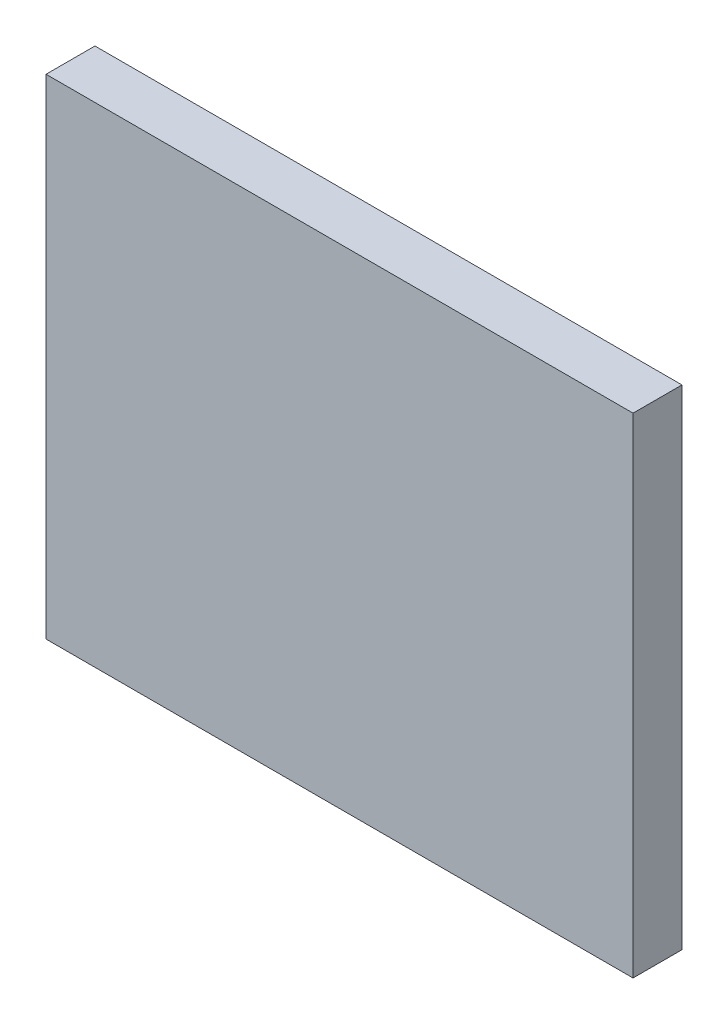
ISO-10303-21;
HEADER;
FILE_DESCRIPTION(('STEP AP214'),'2;1');
FILE_NAME('part.step','',(''),(''),'','','');
FILE_SCHEMA(('AUTOMOTIVE_DESIGN { 1 0 10303 214 1 1 1 1 }'));
ENDSEC;
DATA;
#1=APPLICATION_CONTEXT('core data for automotive mechanical design processes');
#2=APPLICATION_PROTOCOL_DEFINITION('international standard','automotive_design',2000,#1);
#3=PRODUCT_CONTEXT('',#1,'mechanical');
#4=PRODUCT('Part','Part','',(#3));
#5=PRODUCT_RELATED_PRODUCT_CATEGORY('part','',(#4));
#6=PRODUCT_DEFINITION_FORMATION('','',#4);
#7=PRODUCT_DEFINITION_CONTEXT('part definition',#1,'design');
#8=PRODUCT_DEFINITION('design','',#6,#7);
#9=PRODUCT_DEFINITION_SHAPE('','',#8);
#10=(LENGTH_UNIT() NAMED_UNIT(*) SI_UNIT(.MILLI.,.METRE.));
#11=(NAMED_UNIT(*) PLANE_ANGLE_UNIT() SI_UNIT($,.RADIAN.));
#12=(NAMED_UNIT(*) SI_UNIT($,.STERADIAN.) SOLID_ANGLE_UNIT());
#13=UNCERTAINTY_MEASURE_WITH_UNIT(LENGTH_MEASURE(1.E-05),#10,'distance_accuracy_value','');
#14=(GEOMETRIC_REPRESENTATION_CONTEXT(3) GLOBAL_UNCERTAINTY_ASSIGNED_CONTEXT((#13)) GLOBAL_UNIT_ASSIGNED_CONTEXT((#10,
#11,#12)) REPRESENTATION_CONTEXT('',''));
#15=CARTESIAN_POINT('',(0.,0.,0.));
#16=DIRECTION('',(0.,0.,1.));
#17=DIRECTION('',(1.,0.,0.));
#18=AXIS2_PLACEMENT_3D('',#15,#16,#17);
#19=CARTESIAN_POINT('',(0.,0.,5.));
#20=DIRECTION('',(1.,0.,0.));
#21=DIRECTION('',(0.,1.,0.));
#22=AXIS2_PLACEMENT_3D('',#19,#20,#21);
#23=PLANE('',#22);
#24=DIRECTION('',(0.,-1.,0.));
#25=VECTOR('',#24,1.);
#26=CARTESIAN_POINT('',(0.,0.,0.));
#27=LINE('',#26,#25);
#28=CARTESIAN_POINT('',(0.,0.,0.));
#29=VERTEX_POINT('',#28);
#30=CARTESIAN_POINT('',(0.,-50.,0.));
#31=VERTEX_POINT('',#30);
#32=EDGE_CURVE('E75',#29,#31,#27,.T.);
#33=ORIENTED_EDGE('',*,*,#32,.T.);
#34=DIRECTION('',(0.,0.,-1.));
#35=VECTOR('',#34,1.);
#36=CARTESIAN_POINT('',(0.,-50.,5.));
#37=LINE('',#36,#35);
#38=CARTESIAN_POINT('',(0.,-50.,5.));
#39=VERTEX_POINT('',#38);
#40=EDGE_CURVE('E11',#39,#31,#37,.T.);
#41=ORIENTED_EDGE('',*,*,#40,.F.);
#42=DIRECTION('',(0.,-1.,0.));
#43=VECTOR('',#42,1.);
#44=CARTESIAN_POINT('',(0.,0.,5.));
#45=LINE('',#44,#43);
#46=CARTESIAN_POINT('',(0.,0.,5.));
#47=VERTEX_POINT('',#46);
#48=EDGE_CURVE('E93',#47,#39,#45,.T.);
#49=ORIENTED_EDGE('',*,*,#48,.F.);
#50=DIRECTION('',(0.,0.,-1.));
#51=VECTOR('',#50,1.);
#52=CARTESIAN_POINT('',(0.,0.,5.));
#53=LINE('',#52,#51);
#54=EDGE_CURVE('E87',#47,#29,#53,.T.);
#55=ORIENTED_EDGE('',*,*,#54,.T.);
#56=EDGE_LOOP('',(#33,#41,#49,#55));
#57=FACE_BOUND('',#56,.T.);
#58=ADVANCED_FACE('F31',(#57),#23,.F.);
#59=CARTESIAN_POINT('',(0.,-50.,5.));
#60=DIRECTION('',(0.,1.,0.));
#61=DIRECTION('',(0.,0.,1.));
#62=AXIS2_PLACEMENT_3D('',#59,#60,#61);
#63=PLANE('',#62);
#64=DIRECTION('',(1.,0.,0.));
#65=VECTOR('',#64,1.);
#66=CARTESIAN_POINT('',(0.,-50.,0.));
#67=LINE('',#66,#65);
#68=CARTESIAN_POINT('',(60.,-50.,0.));
#69=VERTEX_POINT('',#68);
#70=EDGE_CURVE('E71',#31,#69,#67,.T.);
#71=ORIENTED_EDGE('',*,*,#70,.T.);
#72=DIRECTION('',(0.,0.,-1.));
#73=VECTOR('',#72,1.);
#74=CARTESIAN_POINT('',(60.,-50.,5.));
#75=LINE('',#74,#73);
#76=CARTESIAN_POINT('',(60.,-50.,5.));
#77=VERTEX_POINT('',#76);
#78=EDGE_CURVE('E38',#77,#69,#75,.T.);
#79=ORIENTED_EDGE('',*,*,#78,.F.);
#80=DIRECTION('',(1.,0.,0.));
#81=VECTOR('',#80,1.);
#82=CARTESIAN_POINT('',(0.,-50.,5.));
#83=LINE('',#82,#81);
#84=EDGE_CURVE('E83',#39,#77,#83,.T.);
#85=ORIENTED_EDGE('',*,*,#84,.F.);
#86=ORIENTED_EDGE('',*,*,#40,.T.);
#87=EDGE_LOOP('',(#71,#79,#85,#86));
#88=FACE_BOUND('',#87,.T.);
#89=ADVANCED_FACE('F82',(#88),#63,.F.);
#90=CARTESIAN_POINT('',(60.,0.,5.));
#91=DIRECTION('',(-1.,0.,0.));
#92=DIRECTION('',(0.,-1.,0.));
#93=AXIS2_PLACEMENT_3D('',#90,#91,#92);
#94=PLANE('',#93);
#95=DIRECTION('',(0.,1.,0.));
#96=VECTOR('',#95,1.);
#97=CARTESIAN_POINT('',(60.,0.,0.));
#98=LINE('',#97,#96);
#99=CARTESIAN_POINT('',(60.,0.,0.));
#100=VERTEX_POINT('',#99);
#101=EDGE_CURVE('E76',#69,#100,#98,.T.);
#102=ORIENTED_EDGE('',*,*,#101,.T.);
#103=DIRECTION('',(0.,0.,-1.));
#104=VECTOR('',#103,1.);
#105=CARTESIAN_POINT('',(60.,0.,5.));
#106=LINE('',#105,#104);
#107=CARTESIAN_POINT('',(60.,0.,5.));
#108=VERTEX_POINT('',#107);
#109=EDGE_CURVE('E99',#108,#100,#106,.T.);
#110=ORIENTED_EDGE('',*,*,#109,.F.);
#111=DIRECTION('',(0.,1.,0.));
#112=VECTOR('',#111,1.);
#113=CARTESIAN_POINT('',(60.,0.,5.));
#114=LINE('',#113,#112);
#115=EDGE_CURVE('E50',#77,#108,#114,.T.);
#116=ORIENTED_EDGE('',*,*,#115,.F.);
#117=ORIENTED_EDGE('',*,*,#78,.T.);
#118=EDGE_LOOP('',(#102,#110,#116,#117));
#119=FACE_BOUND('',#118,.T.);
#120=ADVANCED_FACE('F102',(#119),#94,.F.);
#121=CARTESIAN_POINT('',(0.,0.,5.));
#122=DIRECTION('',(0.,-1.,0.));
#123=DIRECTION('',(0.,0.,-1.));
#124=AXIS2_PLACEMENT_3D('',#121,#122,#123);
#125=PLANE('',#124);
#126=DIRECTION('',(-1.,0.,0.));
#127=VECTOR('',#126,1.);
#128=CARTESIAN_POINT('',(0.,0.,0.));
#129=LINE('',#128,#127);
#130=EDGE_CURVE('E91',#100,#29,#129,.T.);
#131=ORIENTED_EDGE('',*,*,#130,.T.);
#132=ORIENTED_EDGE('',*,*,#54,.F.);
#133=DIRECTION('',(-1.,0.,0.));
#134=VECTOR('',#133,1.);
#135=CARTESIAN_POINT('',(0.,0.,5.));
#136=LINE('',#135,#134);
#137=EDGE_CURVE('E45',#108,#47,#136,.T.);
#138=ORIENTED_EDGE('',*,*,#137,.F.);
#139=ORIENTED_EDGE('',*,*,#109,.T.);
#140=EDGE_LOOP('',(#131,#132,#138,#139));
#141=FACE_BOUND('',#140,.T.);
#142=ADVANCED_FACE('F104',(#141),#125,.F.);
#143=CARTESIAN_POINT('',(0.,-50.,5.));
#144=DIRECTION('',(0.,0.,1.));
#145=DIRECTION('',(1.,0.,0.));
#146=AXIS2_PLACEMENT_3D('',#143,#144,#145);
#147=PLANE('',#146);
#148=ORIENTED_EDGE('',*,*,#48,.T.);
#149=ORIENTED_EDGE('',*,*,#84,.T.);
#150=ORIENTED_EDGE('',*,*,#115,.T.);
#151=ORIENTED_EDGE('',*,*,#137,.T.);
#152=EDGE_LOOP('',(#148,#149,#150,#151));
#153=FACE_BOUND('',#152,.T.);
#154=ADVANCED_FACE('F105',(#153),#147,.T.);
#155=CARTESIAN_POINT('',(0.,-50.,0.));
#156=DIRECTION('',(0.,0.,1.));
#157=DIRECTION('',(1.,0.,0.));
#158=AXIS2_PLACEMENT_3D('',#155,#156,#157);
#159=PLANE('',#158);
#160=ORIENTED_EDGE('',*,*,#32,.F.);
#161=ORIENTED_EDGE('',*,*,#130,.F.);
#162=ORIENTED_EDGE('',*,*,#101,.F.);
#163=ORIENTED_EDGE('',*,*,#70,.F.);
#164=EDGE_LOOP('',(#160,#161,#162,#163));
#165=FACE_BOUND('',#164,.T.);
#166=ADVANCED_FACE('F72',(#165),#159,.F.);
#167=CLOSED_SHELL('',(#58,#89,#120,#142,#154,#166));
#168=MANIFOLD_SOLID_BREP('B2',#167);
#169=ADVANCED_BREP_SHAPE_REPRESENTATION('',(#18,#168),#14);
#170=SHAPE_DEFINITION_REPRESENTATION(#9,#169);
ENDSEC;
END-ISO-10303-21;
